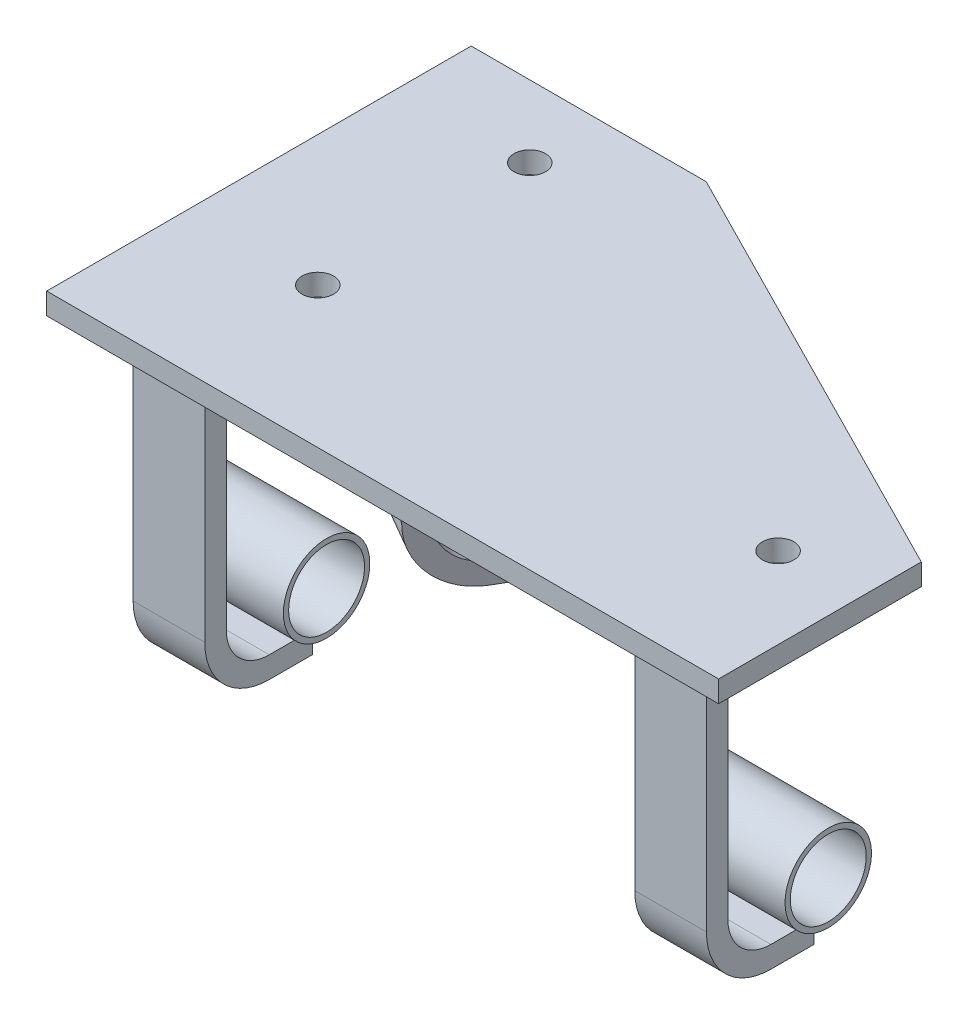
ISO-10303-21;
HEADER;
FILE_DESCRIPTION(('STEP AP214'),'2;1');
FILE_NAME('part.step','',(''),(''),'','','');
FILE_SCHEMA(('AUTOMOTIVE_DESIGN { 1 0 10303 214 1 1 1 1 }'));
ENDSEC;
DATA;
#1=APPLICATION_CONTEXT('core data for automotive mechanical design processes');
#2=APPLICATION_PROTOCOL_DEFINITION('international standard','automotive_design',2000,#1);
#3=PRODUCT_CONTEXT('',#1,'mechanical');
#4=PRODUCT('Part','Part','',(#3));
#5=PRODUCT_RELATED_PRODUCT_CATEGORY('part','',(#4));
#6=PRODUCT_DEFINITION_FORMATION('','',#4);
#7=PRODUCT_DEFINITION_CONTEXT('part definition',#1,'design');
#8=PRODUCT_DEFINITION('design','',#6,#7);
#9=PRODUCT_DEFINITION_SHAPE('','',#8);
#10=(LENGTH_UNIT() NAMED_UNIT(*) SI_UNIT(.MILLI.,.METRE.));
#11=(NAMED_UNIT(*) PLANE_ANGLE_UNIT() SI_UNIT($,.RADIAN.));
#12=(NAMED_UNIT(*) SI_UNIT($,.STERADIAN.) SOLID_ANGLE_UNIT());
#13=UNCERTAINTY_MEASURE_WITH_UNIT(LENGTH_MEASURE(1.E-05),#10,'distance_accuracy_value','');
#14=(GEOMETRIC_REPRESENTATION_CONTEXT(3) GLOBAL_UNCERTAINTY_ASSIGNED_CONTEXT((#13)) GLOBAL_UNIT_ASSIGNED_CONTEXT((#10,
#11,#12)) REPRESENTATION_CONTEXT('',''));
#15=CARTESIAN_POINT('',(0.,0.,0.));
#16=DIRECTION('',(0.,0.,1.));
#17=DIRECTION('',(1.,0.,0.));
#18=AXIS2_PLACEMENT_3D('',#15,#16,#17);
#19=CARTESIAN_POINT('',(21.6435212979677,180.15,-43.2596163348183));
#20=DIRECTION('',(-1.,0.,0.));
#21=DIRECTION('',(0.,0.,1.));
#22=AXIS2_PLACEMENT_3D('',#19,#20,#21);
#23=PLANE('',#22);
#24=DIRECTION('',(0.,0.,-1.));
#25=VECTOR('',#24,1.);
#26=CARTESIAN_POINT('',(21.6435212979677,165.15,-43.2596163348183));
#27=LINE('',#26,#25);
#28=CARTESIAN_POINT('',(21.6435212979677,165.15,98.1634343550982));
#29=VERTEX_POINT('',#28);
#30=CARTESIAN_POINT('',(21.6435212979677,165.15,-43.2596163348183));
#31=VERTEX_POINT('',#30);
#32=EDGE_CURVE('E98',#29,#31,#27,.T.);
#33=ORIENTED_EDGE('',*,*,#32,.T.);
#34=DIRECTION('',(0.,-1.,0.));
#35=VECTOR('',#34,1.);
#36=CARTESIAN_POINT('',(21.6435212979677,180.15,-43.2596163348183));
#37=LINE('',#36,#35);
#38=CARTESIAN_POINT('',(21.6435212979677,180.15,-43.2596163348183));
#39=VERTEX_POINT('',#38);
#40=EDGE_CURVE('E12',#39,#31,#37,.T.);
#41=ORIENTED_EDGE('',*,*,#40,.F.);
#42=DIRECTION('',(0.,0.,-1.));
#43=VECTOR('',#42,1.);
#44=CARTESIAN_POINT('',(21.6435212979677,180.15,-43.2596163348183));
#45=LINE('',#44,#43);
#46=CARTESIAN_POINT('',(21.6435212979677,180.15,98.1634343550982));
#47=VERTEX_POINT('',#46);
#48=EDGE_CURVE('E124',#47,#39,#45,.T.);
#49=ORIENTED_EDGE('',*,*,#48,.F.);
#50=DIRECTION('',(0.,-1.,0.));
#51=VECTOR('',#50,1.);
#52=CARTESIAN_POINT('',(21.6435212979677,180.15,98.1634343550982));
#53=LINE('',#52,#51);
#54=EDGE_CURVE('E111',#47,#29,#53,.T.);
#55=ORIENTED_EDGE('',*,*,#54,.T.);
#56=EDGE_LOOP('',(#33,#41,#49,#55));
#57=FACE_BOUND('',#56,.T.);
#58=ADVANCED_FACE('F48',(#57),#23,.F.);
#59=CARTESIAN_POINT('',(-283.113193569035,180.15,-197.961826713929));
#60=DIRECTION('',(-0.452644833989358,0.,0.891690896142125));
#61=DIRECTION('',(0.891690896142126,0.,0.452644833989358));
#62=AXIS2_PLACEMENT_3D('',#59,#60,#61);
#63=PLANE('',#62);
#64=DIRECTION('',(-0.891690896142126,0.,-0.452644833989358));
#65=VECTOR('',#64,1.);
#66=CARTESIAN_POINT('',(-283.113193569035,165.15,-197.961826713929));
#67=LINE('',#66,#65);
#68=CARTESIAN_POINT('',(-283.113193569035,165.15,-197.961826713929));
#69=VERTEX_POINT('',#68);
#70=EDGE_CURVE('E94',#31,#69,#67,.T.);
#71=ORIENTED_EDGE('',*,*,#70,.T.);
#72=DIRECTION('',(0.,-1.,0.));
#73=VECTOR('',#72,1.);
#74=CARTESIAN_POINT('',(-283.113193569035,180.15,-197.961826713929));
#75=LINE('',#74,#73);
#76=CARTESIAN_POINT('',(-283.113193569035,180.15,-197.961826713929));
#77=VERTEX_POINT('',#76);
#78=EDGE_CURVE('E55',#77,#69,#75,.T.);
#79=ORIENTED_EDGE('',*,*,#78,.F.);
#80=DIRECTION('',(-0.891690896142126,0.,-0.452644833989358));
#81=VECTOR('',#80,1.);
#82=CARTESIAN_POINT('',(-283.113193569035,180.15,-197.961826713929));
#83=LINE('',#82,#81);
#84=EDGE_CURVE('E107',#39,#77,#83,.T.);
#85=ORIENTED_EDGE('',*,*,#84,.F.);
#86=ORIENTED_EDGE('',*,*,#40,.T.);
#87=EDGE_LOOP('',(#71,#79,#85,#86));
#88=FACE_BOUND('',#87,.T.);
#89=ADVANCED_FACE('F106',(#88),#63,.F.);
#90=CARTESIAN_POINT('',(-447.110815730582,180.15,-197.961826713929));
#91=DIRECTION('',(0.,0.,1.));
#92=DIRECTION('',(1.,0.,0.));
#93=AXIS2_PLACEMENT_3D('',#90,#91,#92);
#94=PLANE('',#93);
#95=DIRECTION('',(-1.,0.,0.));
#96=VECTOR('',#95,1.);
#97=CARTESIAN_POINT('',(-447.110815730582,165.15,-197.961826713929));
#98=LINE('',#97,#96);
#99=CARTESIAN_POINT('',(-447.110815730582,165.15,-197.961826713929));
#100=VERTEX_POINT('',#99);
#101=EDGE_CURVE('E100',#69,#100,#98,.T.);
#102=ORIENTED_EDGE('',*,*,#101,.T.);
#103=DIRECTION('',(0.,-1.,0.));
#104=VECTOR('',#103,1.);
#105=CARTESIAN_POINT('',(-447.110815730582,180.15,-197.961826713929));
#106=LINE('',#105,#104);
#107=CARTESIAN_POINT('',(-447.110815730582,180.15,-197.961826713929));
#108=VERTEX_POINT('',#107);
#109=EDGE_CURVE('E135',#108,#100,#106,.T.);
#110=ORIENTED_EDGE('',*,*,#109,.F.);
#111=DIRECTION('',(-1.,0.,0.));
#112=VECTOR('',#111,1.);
#113=CARTESIAN_POINT('',(-447.110815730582,180.15,-197.961826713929));
#114=LINE('',#113,#112);
#115=EDGE_CURVE('E127',#77,#108,#114,.T.);
#116=ORIENTED_EDGE('',*,*,#115,.F.);
#117=ORIENTED_EDGE('',*,*,#78,.T.);
#118=EDGE_LOOP('',(#102,#110,#116,#117));
#119=FACE_BOUND('',#118,.T.);
#120=ADVANCED_FACE('F139',(#119),#94,.F.);
#121=CARTESIAN_POINT('',(-447.110815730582,180.15,98.1634343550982));
#122=DIRECTION('',(1.,0.,0.));
#123=DIRECTION('',(0.,0.,-1.));
#124=AXIS2_PLACEMENT_3D('',#121,#122,#123);
#125=PLANE('',#124);
#126=DIRECTION('',(0.,0.,1.));
#127=VECTOR('',#126,1.);
#128=CARTESIAN_POINT('',(-447.110815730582,165.15,98.1634343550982));
#129=LINE('',#128,#127);
#130=CARTESIAN_POINT('',(-447.110815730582,165.15,98.1634343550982));
#131=VERTEX_POINT('',#130);
#132=EDGE_CURVE('E120',#100,#131,#129,.T.);
#133=ORIENTED_EDGE('',*,*,#132,.T.);
#134=DIRECTION('',(0.,-1.,0.));
#135=VECTOR('',#134,1.);
#136=CARTESIAN_POINT('',(-447.110815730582,180.15,98.1634343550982));
#137=LINE('',#136,#135);
#138=CARTESIAN_POINT('',(-447.110815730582,180.15,98.1634343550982));
#139=VERTEX_POINT('',#138);
#140=EDGE_CURVE('E132',#139,#131,#137,.T.);
#141=ORIENTED_EDGE('',*,*,#140,.F.);
#142=DIRECTION('',(0.,0.,1.));
#143=VECTOR('',#142,1.);
#144=CARTESIAN_POINT('',(-447.110815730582,180.15,98.1634343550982));
#145=LINE('',#144,#143);
#146=EDGE_CURVE('E67',#108,#139,#145,.T.);
#147=ORIENTED_EDGE('',*,*,#146,.F.);
#148=ORIENTED_EDGE('',*,*,#109,.T.);
#149=EDGE_LOOP('',(#133,#141,#147,#148));
#150=FACE_BOUND('',#149,.T.);
#151=ADVANCED_FACE('F153',(#150),#125,.F.);
#152=CARTESIAN_POINT('',(21.6435212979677,180.15,98.1634343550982));
#153=DIRECTION('',(0.,0.,-1.));
#154=DIRECTION('',(-1.,0.,0.));
#155=AXIS2_PLACEMENT_3D('',#152,#153,#154);
#156=PLANE('',#155);
#157=DIRECTION('',(1.,0.,0.));
#158=VECTOR('',#157,1.);
#159=CARTESIAN_POINT('',(21.6435212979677,165.15,98.1634343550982));
#160=LINE('',#159,#158);
#161=EDGE_CURVE('E122',#131,#29,#160,.T.);
#162=ORIENTED_EDGE('',*,*,#161,.T.);
#163=ORIENTED_EDGE('',*,*,#54,.F.);
#164=DIRECTION('',(1.,0.,0.));
#165=VECTOR('',#164,1.);
#166=CARTESIAN_POINT('',(21.6435212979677,180.15,98.1634343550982));
#167=LINE('',#166,#165);
#168=EDGE_CURVE('E62',#139,#47,#167,.T.);
#169=ORIENTED_EDGE('',*,*,#168,.F.);
#170=ORIENTED_EDGE('',*,*,#140,.T.);
#171=EDGE_LOOP('',(#162,#163,#169,#170));
#172=FACE_BOUND('',#171,.T.);
#173=ADVANCED_FACE('F143',(#172),#156,.F.);
#174=CARTESIAN_POINT('',(21.6435212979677,180.15,98.1634343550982));
#175=DIRECTION('',(0.,-1.,0.));
#176=DIRECTION('',(0.,0.,-1.));
#177=AXIS2_PLACEMENT_3D('',#174,#175,#176);
#178=PLANE('',#177);
#179=CARTESIAN_POINT('',(-35.,180.15,0.));
#180=DIRECTION('',(0.,1.,0.));
#181=DIRECTION('',(0.,0.,1.));
#182=AXIS2_PLACEMENT_3D('',#179,#180,#181);
#183=CIRCLE('',#182,11.);
#184=CARTESIAN_POINT('',(-35.,180.15,11.));
#185=VERTEX_POINT('',#184);
#186=EDGE_CURVE('E213',#185,#185,#183,.T.);
#187=ORIENTED_EDGE('',*,*,#186,.F.);
#188=EDGE_LOOP('',(#187));
#189=FACE_BOUND('',#188,.T.);
#190=CARTESIAN_POINT('',(-356.146500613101,180.15,0.));
#191=DIRECTION('',(0.,1.,0.));
#192=DIRECTION('',(0.,0.,1.));
#193=AXIS2_PLACEMENT_3D('',#190,#191,#192);
#194=CIRCLE('',#193,11.);
#195=CARTESIAN_POINT('',(-356.146500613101,180.15,11.));
#196=VERTEX_POINT('',#195);
#197=EDGE_CURVE('E217',#196,#196,#194,.T.);
#198=ORIENTED_EDGE('',*,*,#197,.F.);
#199=EDGE_LOOP('',(#198));
#200=FACE_BOUND('',#199,.T.);
#201=CARTESIAN_POINT('',(-356.146500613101,180.15,-147.886251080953));
#202=DIRECTION('',(0.,1.,0.));
#203=DIRECTION('',(0.,0.,1.));
#204=AXIS2_PLACEMENT_3D('',#201,#202,#203);
#205=CIRCLE('',#204,11.);
#206=CARTESIAN_POINT('',(-356.146500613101,180.15,-136.886251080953));
#207=VERTEX_POINT('',#206);
#208=EDGE_CURVE('E112',#207,#207,#205,.T.);
#209=ORIENTED_EDGE('',*,*,#208,.F.);
#210=EDGE_LOOP('',(#209));
#211=FACE_BOUND('',#210,.T.);
#212=ORIENTED_EDGE('',*,*,#48,.T.);
#213=ORIENTED_EDGE('',*,*,#84,.T.);
#214=ORIENTED_EDGE('',*,*,#115,.T.);
#215=ORIENTED_EDGE('',*,*,#146,.T.);
#216=ORIENTED_EDGE('',*,*,#168,.T.);
#217=EDGE_LOOP('',(#212,#213,#214,#215,#216));
#218=FACE_BOUND('',#217,.T.);
#219=ADVANCED_FACE('F141',(#189,#200,#211,#218),#178,.F.);
#220=CARTESIAN_POINT('',(21.6435212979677,165.15,98.1634343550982));
#221=DIRECTION('',(0.,-1.,0.));
#222=DIRECTION('',(0.,0.,-1.));
#223=AXIS2_PLACEMENT_3D('',#220,#221,#222);
#224=PLANE('',#223);
#225=CARTESIAN_POINT('',(-35.,165.15,0.));
#226=DIRECTION('',(0.,-1.,0.));
#227=DIRECTION('',(0.,0.,-1.));
#228=AXIS2_PLACEMENT_3D('',#225,#226,#227);
#229=CIRCLE('',#228,11.);
#230=CARTESIAN_POINT('',(-35.,165.15,-11.));
#231=VERTEX_POINT('',#230);
#232=EDGE_CURVE('E211',#231,#231,#229,.F.);
#233=ORIENTED_EDGE('',*,*,#232,.T.);
#234=EDGE_LOOP('',(#233));
#235=FACE_BOUND('',#234,.T.);
#236=CARTESIAN_POINT('',(-356.146500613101,165.15,0.));
#237=DIRECTION('',(0.,-1.,0.));
#238=DIRECTION('',(0.,0.,-1.));
#239=AXIS2_PLACEMENT_3D('',#236,#237,#238);
#240=CIRCLE('',#239,11.);
#241=CARTESIAN_POINT('',(-356.146500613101,165.15,-11.));
#242=VERTEX_POINT('',#241);
#243=EDGE_CURVE('E214',#242,#242,#240,.F.);
#244=ORIENTED_EDGE('',*,*,#243,.T.);
#245=EDGE_LOOP('',(#244));
#246=FACE_BOUND('',#245,.T.);
#247=CARTESIAN_POINT('',(-356.146500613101,165.15,-147.886251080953));
#248=DIRECTION('',(0.,-1.,0.));
#249=DIRECTION('',(0.,0.,-1.));
#250=AXIS2_PLACEMENT_3D('',#247,#248,#249);
#251=CIRCLE('',#250,11.);
#252=CARTESIAN_POINT('',(-356.146500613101,165.15,-158.886251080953));
#253=VERTEX_POINT('',#252);
#254=EDGE_CURVE('E115',#253,#253,#251,.F.);
#255=ORIENTED_EDGE('',*,*,#254,.T.);
#256=EDGE_LOOP('',(#255));
#257=FACE_BOUND('',#256,.T.);
#258=ORIENTED_EDGE('',*,*,#32,.F.);
#259=ORIENTED_EDGE('',*,*,#161,.F.);
#260=ORIENTED_EDGE('',*,*,#132,.F.);
#261=ORIENTED_EDGE('',*,*,#101,.F.);
#262=ORIENTED_EDGE('',*,*,#70,.F.);
#263=EDGE_LOOP('',(#258,#259,#260,#261,#262));
#264=FACE_BOUND('',#263,.T.);
#265=ADVANCED_FACE('F95',(#235,#246,#257,#264),#224,.T.);
#266=CARTESIAN_POINT('',(-356.146500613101,-45.1510000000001,-147.886251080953));
#267=DIRECTION('',(0.,1.,0.));
#268=DIRECTION('',(0.,0.,1.));
#269=AXIS2_PLACEMENT_3D('',#266,#267,#268);
#270=CYLINDRICAL_SURFACE('',#269,11.);
#271=ORIENTED_EDGE('',*,*,#254,.F.);
#272=EDGE_LOOP('',(#271));
#273=FACE_BOUND('',#272,.T.);
#274=ORIENTED_EDGE('',*,*,#208,.T.);
#275=EDGE_LOOP('',(#274));
#276=FACE_BOUND('',#275,.T.);
#277=ADVANCED_FACE('F150',(#273,#276),#270,.F.);
#278=CARTESIAN_POINT('',(-356.146500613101,-45.1510000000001,0.));
#279=DIRECTION('',(0.,1.,0.));
#280=DIRECTION('',(0.,0.,1.));
#281=AXIS2_PLACEMENT_3D('',#278,#279,#280);
#282=CYLINDRICAL_SURFACE('',#281,11.);
#283=ORIENTED_EDGE('',*,*,#243,.F.);
#284=EDGE_LOOP('',(#283));
#285=FACE_BOUND('',#284,.T.);
#286=ORIENTED_EDGE('',*,*,#197,.T.);
#287=EDGE_LOOP('',(#286));
#288=FACE_BOUND('',#287,.T.);
#289=ADVANCED_FACE('F190',(#285,#288),#282,.F.);
#290=CARTESIAN_POINT('',(-35.,-45.1510000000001,0.));
#291=DIRECTION('',(0.,1.,0.));
#292=DIRECTION('',(0.,0.,1.));
#293=AXIS2_PLACEMENT_3D('',#290,#291,#292);
#294=CYLINDRICAL_SURFACE('',#293,11.);
#295=ORIENTED_EDGE('',*,*,#232,.F.);
#296=EDGE_LOOP('',(#295));
#297=FACE_BOUND('',#296,.T.);
#298=ORIENTED_EDGE('',*,*,#186,.T.);
#299=EDGE_LOOP('',(#298));
#300=FACE_BOUND('',#299,.T.);
#301=ADVANCED_FACE('F198',(#297,#300),#294,.F.);
#302=CLOSED_SHELL('',(#58,#89,#120,#151,#173,#219,#265,#277,#289,#301));
#303=MANIFOLD_SOLID_BREP('B2',#302);
#304=CARTESIAN_POINT('',(-398.467875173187,-30.15,-103.038475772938));
#305=DIRECTION('',(0.499999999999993,0.,-0.866025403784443));
#306=DIRECTION('',(-0.866025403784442,0.,-0.499999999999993));
#307=AXIS2_PLACEMENT_3D('',#304,#305,#306);
#308=PLANE('',#307);
#309=DIRECTION('',(0.,1.,0.));
#310=VECTOR('',#309,1.);
#311=CARTESIAN_POINT('',(-355.166604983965,-30.15,-78.0384757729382));
#312=LINE('',#311,#310);
#313=CARTESIAN_POINT('',(-355.166604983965,-0.150000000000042,-78.0384757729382));
#314=VERTEX_POINT('',#313);
#315=CARTESIAN_POINT('',(-355.166604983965,165.15,-78.0384757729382));
#316=VERTEX_POINT('',#315);
#317=EDGE_CURVE('E312',#314,#316,#312,.T.);
#318=ORIENTED_EDGE('',*,*,#317,.F.);
#319=DIRECTION('',(0.866025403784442,0.,0.499999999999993));
#320=VECTOR('',#319,1.);
#321=CARTESIAN_POINT('',(-398.467875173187,-0.150000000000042,-103.038475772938));
#322=LINE('',#321,#320);
#323=CARTESIAN_POINT('',(-398.467875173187,-0.150000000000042,-103.038475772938));
#324=VERTEX_POINT('',#323);
#325=EDGE_CURVE('E367',#314,#324,#322,.F.);
#326=ORIENTED_EDGE('',*,*,#325,.T.);
#327=DIRECTION('',(0.,1.,0.));
#328=VECTOR('',#327,1.);
#329=CARTESIAN_POINT('',(-398.467875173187,-30.15,-103.038475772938));
#330=LINE('',#329,#328);
#331=CARTESIAN_POINT('',(-398.467875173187,165.15,-103.038475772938));
#332=VERTEX_POINT('',#331);
#333=EDGE_CURVE('E325',#324,#332,#330,.T.);
#334=ORIENTED_EDGE('',*,*,#333,.T.);
#335=DIRECTION('',(0.866025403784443,0.,0.499999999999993));
#336=VECTOR('',#335,1.);
#337=CARTESIAN_POINT('',(-398.467875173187,165.15,-103.038475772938));
#338=LINE('',#337,#336);
#339=EDGE_CURVE('E323',#332,#316,#338,.T.);
#340=ORIENTED_EDGE('',*,*,#339,.T.);
#341=EDGE_LOOP('',(#318,#326,#334,#340));
#342=FACE_BOUND('',#341,.T.);
#343=ADVANCED_FACE('F251',(#342),#308,.T.);
#344=CARTESIAN_POINT('',(-368.467875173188,-30.15,-155.000000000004));
#345=DIRECTION('',(0.,1.,0.));
#346=DIRECTION('',(0.,0.,1.));
#347=AXIS2_PLACEMENT_3D('',#344,#345,#346);
#348=PLANE('',#347);
#349=DIRECTION('',(-0.499999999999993,0.,0.866025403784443));
#350=VECTOR('',#349,1.);
#351=CARTESIAN_POINT('',(-368.467875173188,-30.15,-155.000000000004));
#352=LINE('',#351,#350);
#353=CARTESIAN_POINT('',(-368.467875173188,-30.15,-155.000000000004));
#354=VERTEX_POINT('',#353);
#355=CARTESIAN_POINT('',(-383.467875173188,-30.15,-129.019237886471));
#356=VERTEX_POINT('',#355);
#357=EDGE_CURVE('E330',#354,#356,#352,.T.);
#358=ORIENTED_EDGE('',*,*,#357,.T.);
#359=DIRECTION('',(0.866025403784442,0.,0.499999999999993));
#360=VECTOR('',#359,1.);
#361=CARTESIAN_POINT('',(-340.166604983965,-30.15,-104.019237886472));
#362=LINE('',#361,#360);
#363=CARTESIAN_POINT('',(-340.166604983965,-30.15,-104.019237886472));
#364=VERTEX_POINT('',#363);
#365=EDGE_CURVE('E360',#356,#364,#362,.T.);
#366=ORIENTED_EDGE('',*,*,#365,.T.);
#367=DIRECTION('',(-0.499999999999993,0.,0.866025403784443));
#368=VECTOR('',#367,1.);
#369=CARTESIAN_POINT('',(-325.166604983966,-30.15,-130.000000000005));
#370=LINE('',#369,#368);
#371=CARTESIAN_POINT('',(-325.166604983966,-30.15,-130.000000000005));
#372=VERTEX_POINT('',#371);
#373=EDGE_CURVE('E343',#372,#364,#370,.T.);
#374=ORIENTED_EDGE('',*,*,#373,.F.);
#375=DIRECTION('',(0.866025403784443,0.,0.499999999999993));
#376=VECTOR('',#375,1.);
#377=CARTESIAN_POINT('',(-368.467875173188,-30.15,-155.000000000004));
#378=LINE('',#377,#376);
#379=EDGE_CURVE('E358',#354,#372,#378,.T.);
#380=ORIENTED_EDGE('',*,*,#379,.F.);
#381=EDGE_LOOP('',(#358,#366,#374,#380));
#382=FACE_BOUND('',#381,.T.);
#383=ADVANCED_FACE('F393',(#382),#348,.T.);
#384=CARTESIAN_POINT('',(-368.467875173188,-45.15,-155.000000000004));
#385=DIRECTION('',(0.499999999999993,0.,-0.866025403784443));
#386=DIRECTION('',(-0.866025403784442,0.,-0.499999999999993));
#387=AXIS2_PLACEMENT_3D('',#384,#385,#386);
#388=PLANE('',#387);
#389=DIRECTION('',(0.,1.,0.));
#390=VECTOR('',#389,1.);
#391=CARTESIAN_POINT('',(-325.166604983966,-45.15,-130.000000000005));
#392=LINE('',#391,#390);
#393=CARTESIAN_POINT('',(-325.166604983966,-45.15,-130.000000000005));
#394=VERTEX_POINT('',#393);
#395=EDGE_CURVE('E340',#394,#372,#392,.T.);
#396=ORIENTED_EDGE('',*,*,#395,.F.);
#397=DIRECTION('',(0.866025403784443,0.,0.499999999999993));
#398=VECTOR('',#397,1.);
#399=CARTESIAN_POINT('',(-368.467875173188,-45.15,-155.000000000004));
#400=LINE('',#399,#398);
#401=CARTESIAN_POINT('',(-368.467875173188,-45.15,-155.000000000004));
#402=VERTEX_POINT('',#401);
#403=EDGE_CURVE('E361',#402,#394,#400,.T.);
#404=ORIENTED_EDGE('',*,*,#403,.F.);
#405=DIRECTION('',(0.,1.,0.));
#406=VECTOR('',#405,1.);
#407=CARTESIAN_POINT('',(-368.467875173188,-45.15,-155.000000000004));
#408=LINE('',#407,#406);
#409=EDGE_CURVE('E353',#402,#354,#408,.T.);
#410=ORIENTED_EDGE('',*,*,#409,.T.);
#411=ORIENTED_EDGE('',*,*,#379,.T.);
#412=EDGE_LOOP('',(#396,#404,#410,#411));
#413=FACE_BOUND('',#412,.T.);
#414=ADVANCED_FACE('F390',(#413),#388,.T.);
#415=CARTESIAN_POINT('',(-405.967875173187,-45.15,-90.0480947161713));
#416=DIRECTION('',(0.,-1.,0.));
#417=DIRECTION('',(0.,0.,-1.));
#418=AXIS2_PLACEMENT_3D('',#415,#416,#417);
#419=PLANE('',#418);
#420=DIRECTION('',(0.499999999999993,0.,-0.866025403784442));
#421=VECTOR('',#420,1.);
#422=CARTESIAN_POINT('',(-362.666604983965,-45.15,-65.0480947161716));
#423=LINE('',#422,#421);
#424=CARTESIAN_POINT('',(-340.166604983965,-45.15,-104.019237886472));
#425=VERTEX_POINT('',#424);
#426=EDGE_CURVE('E336',#425,#394,#423,.T.);
#427=ORIENTED_EDGE('',*,*,#426,.F.);
#428=DIRECTION('',(0.866025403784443,0.,0.499999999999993));
#429=VECTOR('',#428,1.);
#430=CARTESIAN_POINT('',(-383.467875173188,-45.15,-129.019237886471));
#431=LINE('',#430,#429);
#432=CARTESIAN_POINT('',(-383.467875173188,-45.15,-129.019237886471));
#433=VERTEX_POINT('',#432);
#434=EDGE_CURVE('E258',#425,#433,#431,.F.);
#435=ORIENTED_EDGE('',*,*,#434,.T.);
#436=DIRECTION('',(0.499999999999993,0.,-0.866025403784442));
#437=VECTOR('',#436,1.);
#438=CARTESIAN_POINT('',(-405.967875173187,-45.15,-90.0480947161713));
#439=LINE('',#438,#437);
#440=EDGE_CURVE('E351',#433,#402,#439,.T.);
#441=ORIENTED_EDGE('',*,*,#440,.T.);
#442=ORIENTED_EDGE('',*,*,#403,.T.);
#443=EDGE_LOOP('',(#427,#435,#441,#442));
#444=FACE_BOUND('',#443,.T.);
#445=ADVANCED_FACE('F387',(#444),#419,.T.);
#446=CARTESIAN_POINT('',(-405.967875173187,165.15,-90.0480947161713));
#447=DIRECTION('',(-0.499999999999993,0.,0.866025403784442));
#448=DIRECTION('',(0.866025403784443,0.,0.499999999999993));
#449=AXIS2_PLACEMENT_3D('',#446,#447,#448);
#450=PLANE('',#449);
#451=DIRECTION('',(0.,-1.,0.));
#452=VECTOR('',#451,1.);
#453=CARTESIAN_POINT('',(-405.967875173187,165.15,-90.0480947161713));
#454=LINE('',#453,#452);
#455=CARTESIAN_POINT('',(-405.967875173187,165.15,-90.0480947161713));
#456=VERTEX_POINT('',#455);
#457=CARTESIAN_POINT('',(-405.967875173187,-0.149999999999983,-90.0480947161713));
#458=VERTEX_POINT('',#457);
#459=EDGE_CURVE('E348',#456,#458,#454,.T.);
#460=ORIENTED_EDGE('',*,*,#459,.T.);
#461=DIRECTION('',(0.866025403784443,0.,0.499999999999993));
#462=VECTOR('',#461,1.);
#463=CARTESIAN_POINT('',(-405.967875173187,-0.150000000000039,-90.0480947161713));
#464=LINE('',#463,#462);
#465=CARTESIAN_POINT('',(-362.666604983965,-0.149999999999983,-65.0480947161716));
#466=VERTEX_POINT('',#465);
#467=EDGE_CURVE('E372',#458,#466,#464,.T.);
#468=ORIENTED_EDGE('',*,*,#467,.T.);
#469=DIRECTION('',(0.,-1.,0.));
#470=VECTOR('',#469,1.);
#471=CARTESIAN_POINT('',(-362.666604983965,165.15,-65.0480947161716));
#472=LINE('',#471,#470);
#473=CARTESIAN_POINT('',(-362.666604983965,165.15,-65.0480947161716));
#474=VERTEX_POINT('',#473);
#475=EDGE_CURVE('E334',#474,#466,#472,.T.);
#476=ORIENTED_EDGE('',*,*,#475,.F.);
#477=DIRECTION('',(0.866025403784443,0.,0.499999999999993));
#478=VECTOR('',#477,1.);
#479=CARTESIAN_POINT('',(-405.967875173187,165.15,-90.0480947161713));
#480=LINE('',#479,#478);
#481=EDGE_CURVE('E329',#456,#474,#480,.T.);
#482=ORIENTED_EDGE('',*,*,#481,.F.);
#483=EDGE_LOOP('',(#460,#468,#476,#482));
#484=FACE_BOUND('',#483,.T.);
#485=ADVANCED_FACE('F377',(#484),#450,.T.);
#486=CARTESIAN_POINT('',(-398.467875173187,165.15,-103.038475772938));
#487=DIRECTION('',(0.,1.,0.));
#488=DIRECTION('',(0.,0.,1.));
#489=AXIS2_PLACEMENT_3D('',#486,#487,#488);
#490=PLANE('',#489);
#491=DIRECTION('',(-0.499999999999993,0.,0.866025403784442));
#492=VECTOR('',#491,1.);
#493=CARTESIAN_POINT('',(-355.166604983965,165.15,-78.0384757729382));
#494=LINE('',#493,#492);
#495=EDGE_CURVE('E316',#316,#474,#494,.T.);
#496=ORIENTED_EDGE('',*,*,#495,.F.);
#497=ORIENTED_EDGE('',*,*,#339,.F.);
#498=DIRECTION('',(-0.499999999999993,0.,0.866025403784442));
#499=VECTOR('',#498,1.);
#500=CARTESIAN_POINT('',(-398.467875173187,165.15,-103.038475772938));
#501=LINE('',#500,#499);
#502=EDGE_CURVE('E346',#332,#456,#501,.T.);
#503=ORIENTED_EDGE('',*,*,#502,.T.);
#504=ORIENTED_EDGE('',*,*,#481,.T.);
#505=EDGE_LOOP('',(#496,#497,#503,#504));
#506=FACE_BOUND('',#505,.T.);
#507=ADVANCED_FACE('F332',(#506),#490,.T.);
#508=CARTESIAN_POINT('',(-398.467875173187,165.15,-103.038475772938));
#509=DIRECTION('',(0.866025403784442,0.,0.499999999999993));
#510=DIRECTION('',(0.499999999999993,0.,-0.866025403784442));
#511=AXIS2_PLACEMENT_3D('',#508,#509,#510);
#512=PLANE('',#511);
#513=ORIENTED_EDGE('',*,*,#440,.F.);
#514=CARTESIAN_POINT('',(-383.467875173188,-0.150000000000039,-129.019237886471));
#515=DIRECTION('',(0.866025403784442,0.,0.499999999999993));
#516=DIRECTION('',(0.499999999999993,0.,-0.866025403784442));
#517=AXIS2_PLACEMENT_3D('',#514,#515,#516);
#518=CIRCLE('',#517,45.);
#519=EDGE_CURVE('E46',#433,#458,#518,.F.);
#520=ORIENTED_EDGE('',*,*,#519,.T.);
#521=ORIENTED_EDGE('',*,*,#459,.F.);
#522=ORIENTED_EDGE('',*,*,#502,.F.);
#523=ORIENTED_EDGE('',*,*,#333,.F.);
#524=CARTESIAN_POINT('',(-383.467875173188,-0.150000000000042,-129.019237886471));
#525=DIRECTION('',(0.866025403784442,0.,0.499999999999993));
#526=DIRECTION('',(0.499999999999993,0.,-0.866025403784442));
#527=AXIS2_PLACEMENT_3D('',#524,#525,#526);
#528=CIRCLE('',#527,30.);
#529=EDGE_CURVE('E370',#324,#356,#528,.T.);
#530=ORIENTED_EDGE('',*,*,#529,.T.);
#531=ORIENTED_EDGE('',*,*,#357,.F.);
#532=ORIENTED_EDGE('',*,*,#409,.F.);
#533=EDGE_LOOP('',(#513,#520,#521,#522,#523,#530,#531,#532));
#534=FACE_BOUND('',#533,.T.);
#535=ADVANCED_FACE('F383',(#534),#512,.F.);
#536=CARTESIAN_POINT('',(-355.166604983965,165.15,-78.0384757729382));
#537=DIRECTION('',(0.866025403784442,0.,0.499999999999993));
#538=DIRECTION('',(0.499999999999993,0.,-0.866025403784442));
#539=AXIS2_PLACEMENT_3D('',#536,#537,#538);
#540=PLANE('',#539);
#541=ORIENTED_EDGE('',*,*,#475,.T.);
#542=CARTESIAN_POINT('',(-340.166604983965,-0.150000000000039,-104.019237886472));
#543=DIRECTION('',(0.866025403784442,0.,0.499999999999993));
#544=DIRECTION('',(0.499999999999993,0.,-0.866025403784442));
#545=AXIS2_PLACEMENT_3D('',#542,#543,#544);
#546=CIRCLE('',#545,45.);
#547=EDGE_CURVE('E272',#466,#425,#546,.T.);
#548=ORIENTED_EDGE('',*,*,#547,.T.);
#549=ORIENTED_EDGE('',*,*,#426,.T.);
#550=ORIENTED_EDGE('',*,*,#395,.T.);
#551=ORIENTED_EDGE('',*,*,#373,.T.);
#552=CARTESIAN_POINT('',(-340.166604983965,-0.150000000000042,-104.019237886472));
#553=DIRECTION('',(0.866025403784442,0.,0.499999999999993));
#554=DIRECTION('',(0.499999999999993,0.,-0.866025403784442));
#555=AXIS2_PLACEMENT_3D('',#552,#553,#554);
#556=CIRCLE('',#555,30.);
#557=EDGE_CURVE('E318',#364,#314,#556,.F.);
#558=ORIENTED_EDGE('',*,*,#557,.T.);
#559=ORIENTED_EDGE('',*,*,#317,.T.);
#560=ORIENTED_EDGE('',*,*,#495,.T.);
#561=EDGE_LOOP('',(#541,#548,#549,#550,#551,#558,#559,#560));
#562=FACE_BOUND('',#561,.T.);
#563=ADVANCED_FACE('F314',(#562),#540,.T.);
#564=CARTESIAN_POINT('',(-383.467875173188,-0.150000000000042,-129.019237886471));
#565=DIRECTION('',(-0.866025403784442,0.,-0.499999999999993));
#566=DIRECTION('',(-0.499999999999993,0.,0.866025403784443));
#567=AXIS2_PLACEMENT_3D('',#564,#565,#566);
#568=CYLINDRICAL_SURFACE('',#567,30.);
#569=ORIENTED_EDGE('',*,*,#529,.F.);
#570=ORIENTED_EDGE('',*,*,#325,.F.);
#571=ORIENTED_EDGE('',*,*,#557,.F.);
#572=ORIENTED_EDGE('',*,*,#365,.F.);
#573=EDGE_LOOP('',(#569,#570,#571,#572));
#574=FACE_BOUND('',#573,.T.);
#575=ADVANCED_FACE('F397',(#574),#568,.F.);
#576=CARTESIAN_POINT('',(-383.467875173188,-0.150000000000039,-129.019237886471));
#577=DIRECTION('',(0.866025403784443,0.,0.499999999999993));
#578=DIRECTION('',(0.499999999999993,0.,-0.866025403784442));
#579=AXIS2_PLACEMENT_3D('',#576,#577,#578);
#580=CYLINDRICAL_SURFACE('',#579,45.);
#581=ORIENTED_EDGE('',*,*,#519,.F.);
#582=ORIENTED_EDGE('',*,*,#434,.F.);
#583=ORIENTED_EDGE('',*,*,#547,.F.);
#584=ORIENTED_EDGE('',*,*,#467,.F.);
#585=EDGE_LOOP('',(#581,#582,#583,#584));
#586=FACE_BOUND('',#585,.T.);
#587=ADVANCED_FACE('F381',(#586),#580,.T.);
#588=CLOSED_SHELL('',(#343,#383,#414,#445,#485,#507,#535,#563,#575,#587));
#589=MANIFOLD_SOLID_BREP('B6',#588);
#590=CARTESIAN_POINT('',(-410.000000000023,-45.15,1.05809891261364E-13));
#591=DIRECTION('',(0.,0.,-1.));
#592=DIRECTION('',(-1.,0.,0.));
#593=AXIS2_PLACEMENT_3D('',#590,#591,#592);
#594=PLANE('',#593);
#595=DIRECTION('',(0.,1.,0.));
#596=VECTOR('',#595,1.);
#597=CARTESIAN_POINT('',(-360.000000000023,-45.15,0.));
#598=LINE('',#597,#596);
#599=CARTESIAN_POINT('',(-360.000000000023,-45.15,0.));
#600=VERTEX_POINT('',#599);
#601=CARTESIAN_POINT('',(-360.000000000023,-30.15,0.));
#602=VERTEX_POINT('',#601);
#603=EDGE_CURVE('E535',#600,#602,#598,.T.);
#604=ORIENTED_EDGE('',*,*,#603,.F.);
#605=DIRECTION('',(1.,0.,0.));
#606=VECTOR('',#605,1.);
#607=CARTESIAN_POINT('',(-410.000000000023,-45.15,1.05809891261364E-13));
#608=LINE('',#607,#606);
#609=CARTESIAN_POINT('',(-410.000000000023,-45.15,1.05809891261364E-13));
#610=VERTEX_POINT('',#609);
#611=EDGE_CURVE('E576',#610,#600,#608,.T.);
#612=ORIENTED_EDGE('',*,*,#611,.F.);
#613=DIRECTION('',(0.,1.,0.));
#614=VECTOR('',#613,1.);
#615=CARTESIAN_POINT('',(-410.000000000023,-45.15,1.05809891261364E-13));
#616=LINE('',#615,#614);
#617=CARTESIAN_POINT('',(-410.000000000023,-30.15,1.05809891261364E-13));
#618=VERTEX_POINT('',#617);
#619=EDGE_CURVE('E537',#610,#618,#616,.T.);
#620=ORIENTED_EDGE('',*,*,#619,.T.);
#621=DIRECTION('',(1.,0.,0.));
#622=VECTOR('',#621,1.);
#623=CARTESIAN_POINT('',(-410.000000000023,-30.15,1.05809891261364E-13));
#624=LINE('',#623,#622);
#625=EDGE_CURVE('E531',#618,#602,#624,.T.);
#626=ORIENTED_EDGE('',*,*,#625,.T.);
#627=EDGE_LOOP('',(#604,#612,#620,#626));
#628=FACE_BOUND('',#627,.T.);
#629=ADVANCED_FACE('F469',(#628),#594,.T.);
#630=CARTESIAN_POINT('',(-410.000000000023,-45.15,75.0000000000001));
#631=DIRECTION('',(0.,-1.,0.));
#632=DIRECTION('',(0.,0.,-1.));
#633=AXIS2_PLACEMENT_3D('',#630,#631,#632);
#634=PLANE('',#633);
#635=DIRECTION('',(0.,0.,-1.));
#636=VECTOR('',#635,1.);
#637=CARTESIAN_POINT('',(-360.000000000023,-45.15,75.));
#638=LINE('',#637,#636);
#639=CARTESIAN_POINT('',(-360.000000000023,-45.15,30.0000000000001));
#640=VERTEX_POINT('',#639);
#641=EDGE_CURVE('E553',#640,#600,#638,.T.);
#642=ORIENTED_EDGE('',*,*,#641,.F.);
#643=DIRECTION('',(1.,0.,0.));
#644=VECTOR('',#643,1.);
#645=CARTESIAN_POINT('',(-410.000000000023,-45.15,30.0000000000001));
#646=LINE('',#645,#644);
#647=CARTESIAN_POINT('',(-410.000000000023,-45.15,30.0000000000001));
#648=VERTEX_POINT('',#647);
#649=EDGE_CURVE('E476',#640,#648,#646,.F.);
#650=ORIENTED_EDGE('',*,*,#649,.T.);
#651=DIRECTION('',(0.,0.,-1.));
#652=VECTOR('',#651,1.);
#653=CARTESIAN_POINT('',(-410.000000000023,-45.15,75.0000000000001));
#654=LINE('',#653,#652);
#655=EDGE_CURVE('E542',#648,#610,#654,.T.);
#656=ORIENTED_EDGE('',*,*,#655,.T.);
#657=ORIENTED_EDGE('',*,*,#611,.T.);
#658=EDGE_LOOP('',(#642,#650,#656,#657));
#659=FACE_BOUND('',#658,.T.);
#660=ADVANCED_FACE('F619',(#659),#634,.T.);
#661=CARTESIAN_POINT('',(-410.000000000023,165.15,75.0000000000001));
#662=DIRECTION('',(0.,0.,1.));
#663=DIRECTION('',(0.,-1.,0.));
#664=AXIS2_PLACEMENT_3D('',#661,#662,#663);
#665=PLANE('',#664);
#666=DIRECTION('',(0.,-1.,0.));
#667=VECTOR('',#666,1.);
#668=CARTESIAN_POINT('',(-410.000000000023,165.15,75.0000000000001));
#669=LINE('',#668,#667);
#670=CARTESIAN_POINT('',(-410.000000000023,165.15,75.0000000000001));
#671=VERTEX_POINT('',#670);
#672=CARTESIAN_POINT('',(-410.000000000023,-0.149999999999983,75.0000000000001));
#673=VERTEX_POINT('',#672);
#674=EDGE_CURVE('E572',#671,#673,#669,.T.);
#675=ORIENTED_EDGE('',*,*,#674,.T.);
#676=DIRECTION('',(1.,0.,0.));
#677=VECTOR('',#676,1.);
#678=CARTESIAN_POINT('',(-410.000000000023,-0.149999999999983,75.0000000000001));
#679=LINE('',#678,#677);
#680=CARTESIAN_POINT('',(-360.000000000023,-0.149999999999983,75.0000000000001));
#681=VERTEX_POINT('',#680);
#682=EDGE_CURVE('E589',#673,#681,#679,.T.);
#683=ORIENTED_EDGE('',*,*,#682,.T.);
#684=DIRECTION('',(0.,-1.,0.));
#685=VECTOR('',#684,1.);
#686=CARTESIAN_POINT('',(-360.000000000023,165.15,75.0000000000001));
#687=LINE('',#686,#685);
#688=CARTESIAN_POINT('',(-360.000000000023,165.15,75.0000000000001));
#689=VERTEX_POINT('',#688);
#690=EDGE_CURVE('E561',#689,#681,#687,.T.);
#691=ORIENTED_EDGE('',*,*,#690,.F.);
#692=DIRECTION('',(1.,0.,0.));
#693=VECTOR('',#692,1.);
#694=CARTESIAN_POINT('',(-410.000000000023,165.15,75.0000000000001));
#695=LINE('',#694,#693);
#696=EDGE_CURVE('E578',#671,#689,#695,.T.);
#697=ORIENTED_EDGE('',*,*,#696,.F.);
#698=EDGE_LOOP('',(#675,#683,#691,#697));
#699=FACE_BOUND('',#698,.T.);
#700=ADVANCED_FACE('F595',(#699),#665,.T.);
#701=CARTESIAN_POINT('',(-410.000000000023,165.15,60.0000000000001));
#702=DIRECTION('',(0.,1.,0.));
#703=DIRECTION('',(0.,0.,1.));
#704=AXIS2_PLACEMENT_3D('',#701,#702,#703);
#705=PLANE('',#704);
#706=DIRECTION('',(0.,0.,1.));
#707=VECTOR('',#706,1.);
#708=CARTESIAN_POINT('',(-360.000000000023,165.15,60.0000000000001));
#709=LINE('',#708,#707);
#710=CARTESIAN_POINT('',(-360.000000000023,165.15,60.0000000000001));
#711=VERTEX_POINT('',#710);
#712=EDGE_CURVE('E558',#711,#689,#709,.T.);
#713=ORIENTED_EDGE('',*,*,#712,.F.);
#714=DIRECTION('',(1.,0.,0.));
#715=VECTOR('',#714,1.);
#716=CARTESIAN_POINT('',(-410.000000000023,165.15,60.0000000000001));
#717=LINE('',#716,#715);
#718=CARTESIAN_POINT('',(-410.000000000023,165.15,60.0000000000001));
#719=VERTEX_POINT('',#718);
#720=EDGE_CURVE('E541',#719,#711,#717,.T.);
#721=ORIENTED_EDGE('',*,*,#720,.F.);
#722=DIRECTION('',(0.,0.,1.));
#723=VECTOR('',#722,1.);
#724=CARTESIAN_POINT('',(-410.000000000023,165.15,60.0000000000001));
#725=LINE('',#724,#723);
#726=EDGE_CURVE('E569',#719,#671,#725,.T.);
#727=ORIENTED_EDGE('',*,*,#726,.T.);
#728=ORIENTED_EDGE('',*,*,#696,.T.);
#729=EDGE_LOOP('',(#713,#721,#727,#728));
#730=FACE_BOUND('',#729,.T.);
#731=ADVANCED_FACE('F603',(#730),#705,.T.);
#732=CARTESIAN_POINT('',(-410.000000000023,-30.15,60.0000000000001));
#733=DIRECTION('',(0.,0.,-1.));
#734=DIRECTION('',(-1.,0.,0.));
#735=AXIS2_PLACEMENT_3D('',#732,#733,#734);
#736=PLANE('',#735);
#737=DIRECTION('',(0.,1.,0.));
#738=VECTOR('',#737,1.);
#739=CARTESIAN_POINT('',(-360.000000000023,-30.15,60.0000000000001));
#740=LINE('',#739,#738);
#741=CARTESIAN_POINT('',(-360.000000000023,-0.150000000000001,60.0000000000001));
#742=VERTEX_POINT('',#741);
#743=EDGE_CURVE('E550',#742,#711,#740,.T.);
#744=ORIENTED_EDGE('',*,*,#743,.F.);
#745=DIRECTION('',(1.,0.,0.));
#746=VECTOR('',#745,1.);
#747=CARTESIAN_POINT('',(-410.000000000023,-0.150000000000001,60.0000000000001));
#748=LINE('',#747,#746);
#749=CARTESIAN_POINT('',(-410.000000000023,-0.150000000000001,60.0000000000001));
#750=VERTEX_POINT('',#749);
#751=EDGE_CURVE('E583',#742,#750,#748,.F.);
#752=ORIENTED_EDGE('',*,*,#751,.T.);
#753=DIRECTION('',(0.,1.,0.));
#754=VECTOR('',#753,1.);
#755=CARTESIAN_POINT('',(-410.000000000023,-30.15,60.0000000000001));
#756=LINE('',#755,#754);
#757=EDGE_CURVE('E567',#750,#719,#756,.T.);
#758=ORIENTED_EDGE('',*,*,#757,.T.);
#759=ORIENTED_EDGE('',*,*,#720,.T.);
#760=EDGE_LOOP('',(#744,#752,#758,#759));
#761=FACE_BOUND('',#760,.T.);
#762=ADVANCED_FACE('F633',(#761),#736,.T.);
#763=CARTESIAN_POINT('',(-410.000000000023,-30.15,1.05809891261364E-13));
#764=DIRECTION('',(0.,1.,0.));
#765=DIRECTION('',(0.,0.,1.));
#766=AXIS2_PLACEMENT_3D('',#763,#764,#765);
#767=PLANE('',#766);
#768=DIRECTION('',(0.,0.,1.));
#769=VECTOR('',#768,1.);
#770=CARTESIAN_POINT('',(-410.000000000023,-30.15,1.05809891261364E-13));
#771=LINE('',#770,#769);
#772=CARTESIAN_POINT('',(-410.000000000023,-30.15,30.0000000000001));
#773=VERTEX_POINT('',#772);
#774=EDGE_CURVE('E565',#618,#773,#771,.T.);
#775=ORIENTED_EDGE('',*,*,#774,.T.);
#776=DIRECTION('',(1.,0.,0.));
#777=VECTOR('',#776,1.);
#778=CARTESIAN_POINT('',(-360.000000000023,-30.15,30.0000000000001));
#779=LINE('',#778,#777);
#780=CARTESIAN_POINT('',(-360.000000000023,-30.15,30.0000000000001));
#781=VERTEX_POINT('',#780);
#782=EDGE_CURVE('E549',#773,#781,#779,.T.);
#783=ORIENTED_EDGE('',*,*,#782,.T.);
#784=DIRECTION('',(0.,0.,1.));
#785=VECTOR('',#784,1.);
#786=CARTESIAN_POINT('',(-360.000000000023,-30.15,0.));
#787=LINE('',#786,#785);
#788=EDGE_CURVE('E546',#602,#781,#787,.T.);
#789=ORIENTED_EDGE('',*,*,#788,.F.);
#790=ORIENTED_EDGE('',*,*,#625,.F.);
#791=EDGE_LOOP('',(#775,#783,#789,#790));
#792=FACE_BOUND('',#791,.T.);
#793=ADVANCED_FACE('F547',(#792),#767,.T.);
#794=CARTESIAN_POINT('',(-410.000000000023,-30.15,1.05809891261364E-13));
#795=DIRECTION('',(1.,0.,0.));
#796=DIRECTION('',(0.,0.,-1.));
#797=AXIS2_PLACEMENT_3D('',#794,#795,#796);
#798=PLANE('',#797);
#799=ORIENTED_EDGE('',*,*,#655,.F.);
#800=CARTESIAN_POINT('',(-410.000000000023,-0.149999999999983,30.0000000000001));
#801=DIRECTION('',(1.,0.,0.));
#802=DIRECTION('',(0.,0.,-1.));
#803=AXIS2_PLACEMENT_3D('',#800,#801,#802);
#804=CIRCLE('',#803,45.);
#805=EDGE_CURVE('E249',#648,#673,#804,.F.);
#806=ORIENTED_EDGE('',*,*,#805,.T.);
#807=ORIENTED_EDGE('',*,*,#674,.F.);
#808=ORIENTED_EDGE('',*,*,#726,.F.);
#809=ORIENTED_EDGE('',*,*,#757,.F.);
#810=CARTESIAN_POINT('',(-410.000000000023,-0.150000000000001,30.0000000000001));
#811=DIRECTION('',(1.,0.,0.));
#812=DIRECTION('',(0.,0.,-1.));
#813=AXIS2_PLACEMENT_3D('',#810,#811,#812);
#814=CIRCLE('',#813,30.);
#815=EDGE_CURVE('E587',#750,#773,#814,.T.);
#816=ORIENTED_EDGE('',*,*,#815,.T.);
#817=ORIENTED_EDGE('',*,*,#774,.F.);
#818=ORIENTED_EDGE('',*,*,#619,.F.);
#819=EDGE_LOOP('',(#799,#806,#807,#808,#809,#816,#817,#818));
#820=FACE_BOUND('',#819,.T.);
#821=ADVANCED_FACE('F606',(#820),#798,.F.);
#822=CARTESIAN_POINT('',(-360.000000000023,-30.15,0.));
#823=DIRECTION('',(1.,0.,0.));
#824=DIRECTION('',(0.,0.,-1.));
#825=AXIS2_PLACEMENT_3D('',#822,#823,#824);
#826=PLANE('',#825);
#827=ORIENTED_EDGE('',*,*,#690,.T.);
#828=CARTESIAN_POINT('',(-360.000000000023,-0.149999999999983,30.));
#829=DIRECTION('',(1.,0.,0.));
#830=DIRECTION('',(0.,0.,-1.));
#831=AXIS2_PLACEMENT_3D('',#828,#829,#830);
#832=CIRCLE('',#831,45.);
#833=EDGE_CURVE('E490',#681,#640,#832,.T.);
#834=ORIENTED_EDGE('',*,*,#833,.T.);
#835=ORIENTED_EDGE('',*,*,#641,.T.);
#836=ORIENTED_EDGE('',*,*,#603,.T.);
#837=ORIENTED_EDGE('',*,*,#788,.T.);
#838=CARTESIAN_POINT('',(-360.000000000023,-0.150000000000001,30.0000000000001));
#839=DIRECTION('',(1.,0.,0.));
#840=DIRECTION('',(0.,0.,-1.));
#841=AXIS2_PLACEMENT_3D('',#838,#839,#840);
#842=CIRCLE('',#841,30.);
#843=EDGE_CURVE('E585',#781,#742,#842,.F.);
#844=ORIENTED_EDGE('',*,*,#843,.T.);
#845=ORIENTED_EDGE('',*,*,#743,.T.);
#846=ORIENTED_EDGE('',*,*,#712,.T.);
#847=EDGE_LOOP('',(#827,#834,#835,#836,#837,#844,#845,#846));
#848=FACE_BOUND('',#847,.T.);
#849=ADVANCED_FACE('F552',(#848),#826,.T.);
#850=CARTESIAN_POINT('',(-410.000000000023,-0.150000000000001,30.0000000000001));
#851=DIRECTION('',(-1.,0.,0.));
#852=DIRECTION('',(0.,0.,1.));
#853=AXIS2_PLACEMENT_3D('',#850,#851,#852);
#854=CYLINDRICAL_SURFACE('',#853,30.);
#855=ORIENTED_EDGE('',*,*,#815,.F.);
#856=ORIENTED_EDGE('',*,*,#751,.F.);
#857=ORIENTED_EDGE('',*,*,#843,.F.);
#858=ORIENTED_EDGE('',*,*,#782,.F.);
#859=EDGE_LOOP('',(#855,#856,#857,#858));
#860=FACE_BOUND('',#859,.T.);
#861=ADVANCED_FACE('F610',(#860),#854,.F.);
#862=CARTESIAN_POINT('',(-410.000000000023,-0.149999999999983,30.0000000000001));
#863=DIRECTION('',(1.,0.,0.));
#864=DIRECTION('',(0.,0.,-1.));
#865=AXIS2_PLACEMENT_3D('',#862,#863,#864);
#866=CYLINDRICAL_SURFACE('',#865,45.);
#867=ORIENTED_EDGE('',*,*,#805,.F.);
#868=ORIENTED_EDGE('',*,*,#649,.F.);
#869=ORIENTED_EDGE('',*,*,#833,.F.);
#870=ORIENTED_EDGE('',*,*,#682,.F.);
#871=EDGE_LOOP('',(#867,#868,#869,#870));
#872=FACE_BOUND('',#871,.T.);
#873=ADVANCED_FACE('F608',(#872),#866,.T.);
#874=CLOSED_SHELL('',(#629,#660,#700,#731,#762,#793,#821,#849,#861,#873));
#875=MANIFOLD_SOLID_BREP('B40',#874);
#876=CARTESIAN_POINT('',(-60.,-45.15,0.));
#877=DIRECTION('',(0.,0.,-1.));
#878=DIRECTION('',(-1.,0.,0.));
#879=AXIS2_PLACEMENT_3D('',#876,#877,#878);
#880=PLANE('',#879);
#881=DIRECTION('',(0.,1.,0.));
#882=VECTOR('',#881,1.);
#883=CARTESIAN_POINT('',(-10.,-45.15,0.));
#884=LINE('',#883,#882);
#885=CARTESIAN_POINT('',(-10.,-45.15,0.));
#886=VERTEX_POINT('',#885);
#887=CARTESIAN_POINT('',(-10.,-30.15,0.));
#888=VERTEX_POINT('',#887);
#889=EDGE_CURVE('E751',#886,#888,#884,.T.);
#890=ORIENTED_EDGE('',*,*,#889,.F.);
#891=DIRECTION('',(1.,0.,0.));
#892=VECTOR('',#891,1.);
#893=CARTESIAN_POINT('',(-60.,-45.15,0.));
#894=LINE('',#893,#892);
#895=CARTESIAN_POINT('',(-60.,-45.15,0.));
#896=VERTEX_POINT('',#895);
#897=EDGE_CURVE('E792',#896,#886,#894,.T.);
#898=ORIENTED_EDGE('',*,*,#897,.F.);
#899=DIRECTION('',(0.,1.,0.));
#900=VECTOR('',#899,1.);
#901=CARTESIAN_POINT('',(-60.,-45.15,0.));
#902=LINE('',#901,#900);
#903=CARTESIAN_POINT('',(-60.,-30.15,0.));
#904=VERTEX_POINT('',#903);
#905=EDGE_CURVE('E753',#896,#904,#902,.T.);
#906=ORIENTED_EDGE('',*,*,#905,.T.);
#907=DIRECTION('',(1.,0.,0.));
#908=VECTOR('',#907,1.);
#909=CARTESIAN_POINT('',(-60.,-30.15,0.));
#910=LINE('',#909,#908);
#911=EDGE_CURVE('E747',#904,#888,#910,.T.);
#912=ORIENTED_EDGE('',*,*,#911,.T.);
#913=EDGE_LOOP('',(#890,#898,#906,#912));
#914=FACE_BOUND('',#913,.T.);
#915=ADVANCED_FACE('F685',(#914),#880,.T.);
#916=CARTESIAN_POINT('',(-60.,-45.15,75.));
#917=DIRECTION('',(0.,-1.,0.));
#918=DIRECTION('',(0.,0.,-1.));
#919=AXIS2_PLACEMENT_3D('',#916,#917,#918);
#920=PLANE('',#919);
#921=DIRECTION('',(0.,0.,-1.));
#922=VECTOR('',#921,1.);
#923=CARTESIAN_POINT('',(-9.99999999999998,-45.15,75.));
#924=LINE('',#923,#922);
#925=CARTESIAN_POINT('',(-9.99999999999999,-45.15,30.));
#926=VERTEX_POINT('',#925);
#927=EDGE_CURVE('E769',#926,#886,#924,.T.);
#928=ORIENTED_EDGE('',*,*,#927,.F.);
#929=DIRECTION('',(1.,0.,0.));
#930=VECTOR('',#929,1.);
#931=CARTESIAN_POINT('',(-60.,-45.15,30.));
#932=LINE('',#931,#930);
#933=CARTESIAN_POINT('',(-60.,-45.15,30.));
#934=VERTEX_POINT('',#933);
#935=EDGE_CURVE('E692',#926,#934,#932,.F.);
#936=ORIENTED_EDGE('',*,*,#935,.T.);
#937=DIRECTION('',(0.,0.,-1.));
#938=VECTOR('',#937,1.);
#939=CARTESIAN_POINT('',(-60.,-45.15,75.));
#940=LINE('',#939,#938);
#941=EDGE_CURVE('E758',#934,#896,#940,.T.);
#942=ORIENTED_EDGE('',*,*,#941,.T.);
#943=ORIENTED_EDGE('',*,*,#897,.T.);
#944=EDGE_LOOP('',(#928,#936,#942,#943));
#945=FACE_BOUND('',#944,.T.);
#946=ADVANCED_FACE('F835',(#945),#920,.T.);
#947=CARTESIAN_POINT('',(-60.,165.15,75.));
#948=DIRECTION('',(0.,0.,1.));
#949=DIRECTION('',(1.,0.,0.));
#950=AXIS2_PLACEMENT_3D('',#947,#948,#949);
#951=PLANE('',#950);
#952=DIRECTION('',(0.,-1.,0.));
#953=VECTOR('',#952,1.);
#954=CARTESIAN_POINT('',(-60.,165.15,75.));
#955=LINE('',#954,#953);
#956=CARTESIAN_POINT('',(-60.,165.15,75.));
#957=VERTEX_POINT('',#956);
#958=CARTESIAN_POINT('',(-60.,-0.149999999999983,75.));
#959=VERTEX_POINT('',#958);
#960=EDGE_CURVE('E788',#957,#959,#955,.T.);
#961=ORIENTED_EDGE('',*,*,#960,.T.);
#962=DIRECTION('',(1.,0.,0.));
#963=VECTOR('',#962,1.);
#964=CARTESIAN_POINT('',(-60.,-0.149999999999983,75.));
#965=LINE('',#964,#963);
#966=CARTESIAN_POINT('',(-9.99999999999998,-0.149999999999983,75.));
#967=VERTEX_POINT('',#966);
#968=EDGE_CURVE('E805',#959,#967,#965,.T.);
#969=ORIENTED_EDGE('',*,*,#968,.T.);
#970=DIRECTION('',(0.,-1.,0.));
#971=VECTOR('',#970,1.);
#972=CARTESIAN_POINT('',(-9.99999999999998,165.15,75.));
#973=LINE('',#972,#971);
#974=CARTESIAN_POINT('',(-9.99999999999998,165.15,75.));
#975=VERTEX_POINT('',#974);
#976=EDGE_CURVE('E777',#975,#967,#973,.T.);
#977=ORIENTED_EDGE('',*,*,#976,.F.);
#978=DIRECTION('',(1.,0.,0.));
#979=VECTOR('',#978,1.);
#980=CARTESIAN_POINT('',(-60.,165.15,75.));
#981=LINE('',#980,#979);
#982=EDGE_CURVE('E794',#957,#975,#981,.T.);
#983=ORIENTED_EDGE('',*,*,#982,.F.);
#984=EDGE_LOOP('',(#961,#969,#977,#983));
#985=FACE_BOUND('',#984,.T.);
#986=ADVANCED_FACE('F811',(#985),#951,.T.);
#987=CARTESIAN_POINT('',(-60.,165.15,60.));
#988=DIRECTION('',(0.,1.,0.));
#989=DIRECTION('',(0.,0.,1.));
#990=AXIS2_PLACEMENT_3D('',#987,#988,#989);
#991=PLANE('',#990);
#992=DIRECTION('',(0.,0.,1.));
#993=VECTOR('',#992,1.);
#994=CARTESIAN_POINT('',(-9.99999999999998,165.15,60.));
#995=LINE('',#994,#993);
#996=CARTESIAN_POINT('',(-9.99999999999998,165.15,60.));
#997=VERTEX_POINT('',#996);
#998=EDGE_CURVE('E774',#997,#975,#995,.T.);
#999=ORIENTED_EDGE('',*,*,#998,.F.);
#1000=DIRECTION('',(1.,0.,0.));
#1001=VECTOR('',#1000,1.);
#1002=CARTESIAN_POINT('',(-60.,165.15,60.));
#1003=LINE('',#1002,#1001);
#1004=CARTESIAN_POINT('',(-60.,165.15,60.));
#1005=VERTEX_POINT('',#1004);
#1006=EDGE_CURVE('E757',#1005,#997,#1003,.T.);
#1007=ORIENTED_EDGE('',*,*,#1006,.F.);
#1008=DIRECTION('',(0.,0.,1.));
#1009=VECTOR('',#1008,1.);
#1010=CARTESIAN_POINT('',(-60.,165.15,60.));
#1011=LINE('',#1010,#1009);
#1012=EDGE_CURVE('E785',#1005,#957,#1011,.T.);
#1013=ORIENTED_EDGE('',*,*,#1012,.T.);
#1014=ORIENTED_EDGE('',*,*,#982,.T.);
#1015=EDGE_LOOP('',(#999,#1007,#1013,#1014));
#1016=FACE_BOUND('',#1015,.T.);
#1017=ADVANCED_FACE('F819',(#1016),#991,.T.);
#1018=CARTESIAN_POINT('',(-60.,-30.15,60.));
#1019=DIRECTION('',(0.,0.,-1.));
#1020=DIRECTION('',(-1.,0.,0.));
#1021=AXIS2_PLACEMENT_3D('',#1018,#1019,#1020);
#1022=PLANE('',#1021);
#1023=DIRECTION('',(0.,1.,0.));
#1024=VECTOR('',#1023,1.);
#1025=CARTESIAN_POINT('',(-9.99999999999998,-30.15,60.));
#1026=LINE('',#1025,#1024);
#1027=CARTESIAN_POINT('',(-9.99999999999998,-0.150000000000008,60.));
#1028=VERTEX_POINT('',#1027);
#1029=EDGE_CURVE('E766',#1028,#997,#1026,.T.);
#1030=ORIENTED_EDGE('',*,*,#1029,.F.);
#1031=DIRECTION('',(1.,0.,0.));
#1032=VECTOR('',#1031,1.);
#1033=CARTESIAN_POINT('',(-60.,-0.150000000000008,60.));
#1034=LINE('',#1033,#1032);
#1035=CARTESIAN_POINT('',(-60.,-0.150000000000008,60.));
#1036=VERTEX_POINT('',#1035);
#1037=EDGE_CURVE('E799',#1028,#1036,#1034,.F.);
#1038=ORIENTED_EDGE('',*,*,#1037,.T.);
#1039=DIRECTION('',(0.,1.,0.));
#1040=VECTOR('',#1039,1.);
#1041=CARTESIAN_POINT('',(-60.,-30.15,60.));
#1042=LINE('',#1041,#1040);
#1043=EDGE_CURVE('E783',#1036,#1005,#1042,.T.);
#1044=ORIENTED_EDGE('',*,*,#1043,.T.);
#1045=ORIENTED_EDGE('',*,*,#1006,.T.);
#1046=EDGE_LOOP('',(#1030,#1038,#1044,#1045));
#1047=FACE_BOUND('',#1046,.T.);
#1048=ADVANCED_FACE('F849',(#1047),#1022,.T.);
#1049=CARTESIAN_POINT('',(-60.,-30.15,0.));
#1050=DIRECTION('',(0.,1.,0.));
#1051=DIRECTION('',(0.,0.,1.));
#1052=AXIS2_PLACEMENT_3D('',#1049,#1050,#1051);
#1053=PLANE('',#1052);
#1054=DIRECTION('',(0.,0.,1.));
#1055=VECTOR('',#1054,1.);
#1056=CARTESIAN_POINT('',(-60.,-30.15,0.));
#1057=LINE('',#1056,#1055);
#1058=CARTESIAN_POINT('',(-60.,-30.15,30.));
#1059=VERTEX_POINT('',#1058);
#1060=EDGE_CURVE('E781',#904,#1059,#1057,.T.);
#1061=ORIENTED_EDGE('',*,*,#1060,.T.);
#1062=DIRECTION('',(1.,0.,0.));
#1063=VECTOR('',#1062,1.);
#1064=CARTESIAN_POINT('',(-9.99999999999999,-30.15,30.));
#1065=LINE('',#1064,#1063);
#1066=CARTESIAN_POINT('',(-9.99999999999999,-30.15,30.));
#1067=VERTEX_POINT('',#1066);
#1068=EDGE_CURVE('E765',#1059,#1067,#1065,.T.);
#1069=ORIENTED_EDGE('',*,*,#1068,.T.);
#1070=DIRECTION('',(0.,0.,1.));
#1071=VECTOR('',#1070,1.);
#1072=CARTESIAN_POINT('',(-10.,-30.15,0.));
#1073=LINE('',#1072,#1071);
#1074=EDGE_CURVE('E762',#888,#1067,#1073,.T.);
#1075=ORIENTED_EDGE('',*,*,#1074,.F.);
#1076=ORIENTED_EDGE('',*,*,#911,.F.);
#1077=EDGE_LOOP('',(#1061,#1069,#1075,#1076));
#1078=FACE_BOUND('',#1077,.T.);
#1079=ADVANCED_FACE('F763',(#1078),#1053,.T.);
#1080=CARTESIAN_POINT('',(-60.,165.15,0.));
#1081=DIRECTION('',(1.,0.,0.));
#1082=DIRECTION('',(0.,0.,-1.));
#1083=AXIS2_PLACEMENT_3D('',#1080,#1081,#1082);
#1084=PLANE('',#1083);
#1085=ORIENTED_EDGE('',*,*,#941,.F.);
#1086=CARTESIAN_POINT('',(-60.,-0.149999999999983,30.));
#1087=DIRECTION('',(1.,0.,0.));
#1088=DIRECTION('',(0.,0.,-1.));
#1089=AXIS2_PLACEMENT_3D('',#1086,#1087,#1088);
#1090=CIRCLE('',#1089,45.);
#1091=EDGE_CURVE('E467',#934,#959,#1090,.F.);
#1092=ORIENTED_EDGE('',*,*,#1091,.T.);
#1093=ORIENTED_EDGE('',*,*,#960,.F.);
#1094=ORIENTED_EDGE('',*,*,#1012,.F.);
#1095=ORIENTED_EDGE('',*,*,#1043,.F.);
#1096=CARTESIAN_POINT('',(-60.,-0.150000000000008,30.));
#1097=DIRECTION('',(1.,0.,0.));
#1098=DIRECTION('',(0.,0.,-1.));
#1099=AXIS2_PLACEMENT_3D('',#1096,#1097,#1098);
#1100=CIRCLE('',#1099,30.);
#1101=EDGE_CURVE('E803',#1036,#1059,#1100,.T.);
#1102=ORIENTED_EDGE('',*,*,#1101,.T.);
#1103=ORIENTED_EDGE('',*,*,#1060,.F.);
#1104=ORIENTED_EDGE('',*,*,#905,.F.);
#1105=EDGE_LOOP('',(#1085,#1092,#1093,#1094,#1095,#1102,#1103,#1104));
#1106=FACE_BOUND('',#1105,.T.);
#1107=ADVANCED_FACE('F822',(#1106),#1084,.F.);
#1108=CARTESIAN_POINT('',(-10.,165.15,0.));
#1109=DIRECTION('',(1.,0.,0.));
#1110=DIRECTION('',(0.,0.,-1.));
#1111=AXIS2_PLACEMENT_3D('',#1108,#1109,#1110);
#1112=PLANE('',#1111);
#1113=ORIENTED_EDGE('',*,*,#976,.T.);
#1114=CARTESIAN_POINT('',(-9.99999999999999,-0.149999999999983,30.));
#1115=DIRECTION('',(1.,0.,0.));
#1116=DIRECTION('',(0.,0.,-1.));
#1117=AXIS2_PLACEMENT_3D('',#1114,#1115,#1116);
#1118=CIRCLE('',#1117,45.);
#1119=EDGE_CURVE('E706',#967,#926,#1118,.T.);
#1120=ORIENTED_EDGE('',*,*,#1119,.T.);
#1121=ORIENTED_EDGE('',*,*,#927,.T.);
#1122=ORIENTED_EDGE('',*,*,#889,.T.);
#1123=ORIENTED_EDGE('',*,*,#1074,.T.);
#1124=CARTESIAN_POINT('',(-9.99999999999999,-0.150000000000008,30.));
#1125=DIRECTION('',(1.,0.,0.));
#1126=DIRECTION('',(0.,0.,-1.));
#1127=AXIS2_PLACEMENT_3D('',#1124,#1125,#1126);
#1128=CIRCLE('',#1127,30.);
#1129=EDGE_CURVE('E801',#1067,#1028,#1128,.F.);
#1130=ORIENTED_EDGE('',*,*,#1129,.T.);
#1131=ORIENTED_EDGE('',*,*,#1029,.T.);
#1132=ORIENTED_EDGE('',*,*,#998,.T.);
#1133=EDGE_LOOP('',(#1113,#1120,#1121,#1122,#1123,#1130,#1131,#1132));
#1134=FACE_BOUND('',#1133,.T.);
#1135=ADVANCED_FACE('F768',(#1134),#1112,.T.);
#1136=CARTESIAN_POINT('',(-60.,-0.150000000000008,30.));
#1137=DIRECTION('',(-1.,0.,0.));
#1138=DIRECTION('',(0.,0.,1.));
#1139=AXIS2_PLACEMENT_3D('',#1136,#1137,#1138);
#1140=CYLINDRICAL_SURFACE('',#1139,30.);
#1141=ORIENTED_EDGE('',*,*,#1101,.F.);
#1142=ORIENTED_EDGE('',*,*,#1037,.F.);
#1143=ORIENTED_EDGE('',*,*,#1129,.F.);
#1144=ORIENTED_EDGE('',*,*,#1068,.F.);
#1145=EDGE_LOOP('',(#1141,#1142,#1143,#1144));
#1146=FACE_BOUND('',#1145,.T.);
#1147=ADVANCED_FACE('F826',(#1146),#1140,.F.);
#1148=CARTESIAN_POINT('',(-60.,-0.149999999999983,30.));
#1149=DIRECTION('',(1.,0.,0.));
#1150=DIRECTION('',(0.,0.,-1.));
#1151=AXIS2_PLACEMENT_3D('',#1148,#1149,#1150);
#1152=CYLINDRICAL_SURFACE('',#1151,45.);
#1153=ORIENTED_EDGE('',*,*,#1091,.F.);
#1154=ORIENTED_EDGE('',*,*,#935,.F.);
#1155=ORIENTED_EDGE('',*,*,#1119,.F.);
#1156=ORIENTED_EDGE('',*,*,#968,.F.);
#1157=EDGE_LOOP('',(#1153,#1154,#1155,#1156));
#1158=FACE_BOUND('',#1157,.T.);
#1159=ADVANCED_FACE('F824',(#1158),#1152,.T.);
#1160=CLOSED_SHELL('',(#915,#946,#986,#1017,#1048,#1079,#1107,#1135,#1147,#1159));
#1161=MANIFOLD_SOLID_BREP('B243',#1160);
#1162=CARTESIAN_POINT('',(-316.50635094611,0.,-124.999999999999));
#1163=DIRECTION('',(-0.866025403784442,0.,-0.499999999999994));
#1164=DIRECTION('',(-0.499999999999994,0.,0.866025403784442));
#1165=AXIS2_PLACEMENT_3D('',#1162,#1163,#1164);
#1166=CYLINDRICAL_SURFACE('',#1165,26.5);
#1167=CARTESIAN_POINT('',(-316.50635094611,0.,-124.999999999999));
#1168=DIRECTION('',(0.866025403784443,0.,0.499999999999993));
#1169=DIRECTION('',(0.499999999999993,0.,-0.866025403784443));
#1170=AXIS2_PLACEMENT_3D('',#1167,#1168,#1169);
#1171=CIRCLE('',#1170,26.5);
#1172=CARTESIAN_POINT('',(-303.256350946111,0.,-147.949673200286));
#1173=VERTEX_POINT('',#1172);
#1174=EDGE_CURVE('E907',#1173,#1173,#1171,.T.);
#1175=ORIENTED_EDGE('',*,*,#1174,.T.);
#1176=EDGE_LOOP('',(#1175));
#1177=FACE_BOUND('',#1176,.T.);
#1178=CARTESIAN_POINT('',(-403.108891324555,0.,-174.999999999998));
#1179=DIRECTION('',(0.866025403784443,0.,0.499999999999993));
#1180=DIRECTION('',(0.499999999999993,0.,-0.866025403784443));
#1181=AXIS2_PLACEMENT_3D('',#1178,#1179,#1180);
#1182=CIRCLE('',#1181,26.5);
#1183=CARTESIAN_POINT('',(-389.858891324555,0.,-197.949673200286));
#1184=VERTEX_POINT('',#1183);
#1185=EDGE_CURVE('E915',#1184,#1184,#1182,.T.);
#1186=ORIENTED_EDGE('',*,*,#1185,.F.);
#1187=EDGE_LOOP('',(#1186));
#1188=FACE_BOUND('',#1187,.T.);
#1189=ADVANCED_FACE('F901',(#1177,#1188),#1166,.F.);
#1190=CARTESIAN_POINT('',(-316.50635094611,0.,-124.999999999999));
#1191=DIRECTION('',(-0.866025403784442,0.,-0.499999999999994));
#1192=DIRECTION('',(-0.499999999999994,0.,0.866025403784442));
#1193=AXIS2_PLACEMENT_3D('',#1190,#1191,#1192);
#1194=CYLINDRICAL_SURFACE('',#1193,30.15);
#1195=CARTESIAN_POINT('',(-316.50635094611,0.,-124.999999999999));
#1196=DIRECTION('',(0.866025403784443,0.,0.499999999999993));
#1197=DIRECTION('',(0.499999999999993,0.,-0.866025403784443));
#1198=AXIS2_PLACEMENT_3D('',#1195,#1196,#1197);
#1199=CIRCLE('',#1198,30.15);
#1200=CARTESIAN_POINT('',(-301.431350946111,0.,-151.1106659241));
#1201=VERTEX_POINT('',#1200);
#1202=EDGE_CURVE('E684',#1201,#1201,#1199,.T.);
#1203=ORIENTED_EDGE('',*,*,#1202,.F.);
#1204=EDGE_LOOP('',(#1203));
#1205=FACE_BOUND('',#1204,.T.);
#1206=CARTESIAN_POINT('',(-403.108891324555,0.,-174.999999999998));
#1207=DIRECTION('',(0.866025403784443,0.,0.499999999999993));
#1208=DIRECTION('',(0.499999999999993,0.,-0.866025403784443));
#1209=AXIS2_PLACEMENT_3D('',#1206,#1207,#1208);
#1210=CIRCLE('',#1209,30.15);
#1211=CARTESIAN_POINT('',(-388.033891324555,0.,-201.110665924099));
#1212=VERTEX_POINT('',#1211);
#1213=EDGE_CURVE('E911',#1212,#1212,#1210,.T.);
#1214=ORIENTED_EDGE('',*,*,#1213,.T.);
#1215=EDGE_LOOP('',(#1214));
#1216=FACE_BOUND('',#1215,.T.);
#1217=ADVANCED_FACE('F925',(#1205,#1216),#1194,.T.);
#1218=CARTESIAN_POINT('',(-316.50635094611,0.,-124.999999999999));
#1219=DIRECTION('',(0.866025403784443,0.,0.499999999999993));
#1220=DIRECTION('',(0.499999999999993,0.,-0.866025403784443));
#1221=AXIS2_PLACEMENT_3D('',#1218,#1219,#1220);
#1222=PLANE('',#1221);
#1223=ORIENTED_EDGE('',*,*,#1174,.F.);
#1224=EDGE_LOOP('',(#1223));
#1225=FACE_BOUND('',#1224,.T.);
#1226=ORIENTED_EDGE('',*,*,#1202,.T.);
#1227=EDGE_LOOP('',(#1226));
#1228=FACE_BOUND('',#1227,.T.);
#1229=ADVANCED_FACE('F929',(#1225,#1228),#1222,.T.);
#1230=CARTESIAN_POINT('',(-403.108891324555,0.,-174.999999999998));
#1231=DIRECTION('',(0.866025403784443,0.,0.499999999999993));
#1232=DIRECTION('',(0.499999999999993,0.,-0.866025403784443));
#1233=AXIS2_PLACEMENT_3D('',#1230,#1231,#1232);
#1234=PLANE('',#1233);
#1235=ORIENTED_EDGE('',*,*,#1185,.T.);
#1236=EDGE_LOOP('',(#1235));
#1237=FACE_BOUND('',#1236,.T.);
#1238=ORIENTED_EDGE('',*,*,#1213,.F.);
#1239=EDGE_LOOP('',(#1238));
#1240=FACE_BOUND('',#1239,.T.);
#1241=ADVANCED_FACE('F921',(#1237,#1240),#1234,.F.);
#1242=CLOSED_SHELL('',(#1189,#1217,#1229,#1241));
#1243=MANIFOLD_SOLID_BREP('B461',#1242);
#1244=CARTESIAN_POINT('',(-100.,0.,0.));
#1245=DIRECTION('',(1.,0.,0.));
#1246=DIRECTION('',(0.,0.,-1.));
#1247=AXIS2_PLACEMENT_3D('',#1244,#1245,#1246);
#1248=CYLINDRICAL_SURFACE('',#1247,26.5);
#1249=CARTESIAN_POINT('',(-100.,0.,0.));
#1250=DIRECTION('',(-1.,0.,0.));
#1251=DIRECTION('',(0.,0.,1.));
#1252=AXIS2_PLACEMENT_3D('',#1249,#1250,#1251);
#1253=CIRCLE('',#1252,26.5);
#1254=CARTESIAN_POINT('',(-100.,0.,26.5));
#1255=VERTEX_POINT('',#1254);
#1256=EDGE_CURVE('E976',#1255,#1255,#1253,.T.);
#1257=ORIENTED_EDGE('',*,*,#1256,.T.);
#1258=EDGE_LOOP('',(#1257));
#1259=FACE_BOUND('',#1258,.T.);
#1260=CARTESIAN_POINT('',(0.,0.,0.));
#1261=DIRECTION('',(-1.,0.,0.));
#1262=DIRECTION('',(0.,0.,1.));
#1263=AXIS2_PLACEMENT_3D('',#1260,#1261,#1262);
#1264=CIRCLE('',#1263,26.5);
#1265=CARTESIAN_POINT('',(0.,0.,26.5));
#1266=VERTEX_POINT('',#1265);
#1267=EDGE_CURVE('E984',#1266,#1266,#1264,.T.);
#1268=ORIENTED_EDGE('',*,*,#1267,.F.);
#1269=EDGE_LOOP('',(#1268));
#1270=FACE_BOUND('',#1269,.T.);
#1271=ADVANCED_FACE('F970',(#1259,#1270),#1248,.F.);
#1272=CARTESIAN_POINT('',(-100.,0.,0.));
#1273=DIRECTION('',(1.,0.,0.));
#1274=DIRECTION('',(0.,0.,-1.));
#1275=AXIS2_PLACEMENT_3D('',#1272,#1273,#1274);
#1276=CYLINDRICAL_SURFACE('',#1275,30.15);
#1277=CARTESIAN_POINT('',(-100.,0.,0.));
#1278=DIRECTION('',(-1.,0.,0.));
#1279=DIRECTION('',(0.,0.,1.));
#1280=AXIS2_PLACEMENT_3D('',#1277,#1278,#1279);
#1281=CIRCLE('',#1280,30.15);
#1282=CARTESIAN_POINT('',(-100.,0.,30.15));
#1283=VERTEX_POINT('',#1282);
#1284=EDGE_CURVE('E900',#1283,#1283,#1281,.T.);
#1285=ORIENTED_EDGE('',*,*,#1284,.F.);
#1286=EDGE_LOOP('',(#1285));
#1287=FACE_BOUND('',#1286,.T.);
#1288=CARTESIAN_POINT('',(0.,0.,0.));
#1289=DIRECTION('',(-1.,0.,0.));
#1290=DIRECTION('',(0.,0.,1.));
#1291=AXIS2_PLACEMENT_3D('',#1288,#1289,#1290);
#1292=CIRCLE('',#1291,30.15);
#1293=CARTESIAN_POINT('',(0.,0.,30.15));
#1294=VERTEX_POINT('',#1293);
#1295=EDGE_CURVE('E980',#1294,#1294,#1292,.T.);
#1296=ORIENTED_EDGE('',*,*,#1295,.T.);
#1297=EDGE_LOOP('',(#1296));
#1298=FACE_BOUND('',#1297,.T.);
#1299=ADVANCED_FACE('F994',(#1287,#1298),#1276,.T.);
#1300=CARTESIAN_POINT('',(-100.,0.,0.));
#1301=DIRECTION('',(-1.,0.,0.));
#1302=DIRECTION('',(0.,0.,1.));
#1303=AXIS2_PLACEMENT_3D('',#1300,#1301,#1302);
#1304=PLANE('',#1303);
#1305=ORIENTED_EDGE('',*,*,#1256,.F.);
#1306=EDGE_LOOP('',(#1305));
#1307=FACE_BOUND('',#1306,.T.);
#1308=ORIENTED_EDGE('',*,*,#1284,.T.);
#1309=EDGE_LOOP('',(#1308));
#1310=FACE_BOUND('',#1309,.T.);
#1311=ADVANCED_FACE('F998',(#1307,#1310),#1304,.T.);
#1312=CARTESIAN_POINT('',(0.,0.,0.));
#1313=DIRECTION('',(-1.,0.,0.));
#1314=DIRECTION('',(0.,0.,1.));
#1315=AXIS2_PLACEMENT_3D('',#1312,#1313,#1314);
#1316=PLANE('',#1315);
#1317=ORIENTED_EDGE('',*,*,#1267,.T.);
#1318=EDGE_LOOP('',(#1317));
#1319=FACE_BOUND('',#1318,.T.);
#1320=ORIENTED_EDGE('',*,*,#1295,.F.);
#1321=EDGE_LOOP('',(#1320));
#1322=FACE_BOUND('',#1321,.T.);
#1323=ADVANCED_FACE('F990',(#1319,#1322),#1316,.F.);
#1324=CLOSED_SHELL('',(#1271,#1299,#1311,#1323));
#1325=MANIFOLD_SOLID_BREP('B679',#1324);
#1326=CARTESIAN_POINT('',(-450.,0.,0.));
#1327=DIRECTION('',(1.,0.,0.));
#1328=DIRECTION('',(0.,0.,-1.));
#1329=AXIS2_PLACEMENT_3D('',#1326,#1327,#1328);
#1330=CYLINDRICAL_SURFACE('',#1329,26.5);
#1331=CARTESIAN_POINT('',(-450.,0.,0.));
#1332=DIRECTION('',(-1.,0.,0.));
#1333=DIRECTION('',(0.,0.,1.));
#1334=AXIS2_PLACEMENT_3D('',#1331,#1332,#1333);
#1335=CIRCLE('',#1334,26.5);
#1336=CARTESIAN_POINT('',(-450.,0.,26.5));
#1337=VERTEX_POINT('',#1336);
#1338=EDGE_CURVE('E1038',#1337,#1337,#1335,.T.);
#1339=ORIENTED_EDGE('',*,*,#1338,.T.);
#1340=EDGE_LOOP('',(#1339));
#1341=FACE_BOUND('',#1340,.T.);
#1342=CARTESIAN_POINT('',(-350.,0.,0.));
#1343=DIRECTION('',(-1.,0.,0.));
#1344=DIRECTION('',(0.,0.,1.));
#1345=AXIS2_PLACEMENT_3D('',#1342,#1343,#1344);
#1346=CIRCLE('',#1345,26.5);
#1347=CARTESIAN_POINT('',(-350.,0.,26.5));
#1348=VERTEX_POINT('',#1347);
#1349=EDGE_CURVE('E1046',#1348,#1348,#1346,.T.);
#1350=ORIENTED_EDGE('',*,*,#1349,.F.);
#1351=EDGE_LOOP('',(#1350));
#1352=FACE_BOUND('',#1351,.T.);
#1353=ADVANCED_FACE('F1032',(#1341,#1352),#1330,.F.);
#1354=CARTESIAN_POINT('',(-450.,0.,0.));
#1355=DIRECTION('',(1.,0.,0.));
#1356=DIRECTION('',(0.,0.,-1.));
#1357=AXIS2_PLACEMENT_3D('',#1354,#1355,#1356);
#1358=CYLINDRICAL_SURFACE('',#1357,30.15);
#1359=CARTESIAN_POINT('',(-450.,0.,0.));
#1360=DIRECTION('',(-1.,0.,0.));
#1361=DIRECTION('',(0.,0.,1.));
#1362=AXIS2_PLACEMENT_3D('',#1359,#1360,#1361);
#1363=CIRCLE('',#1362,30.15);
#1364=CARTESIAN_POINT('',(-450.,0.,30.15));
#1365=VERTEX_POINT('',#1364);
#1366=EDGE_CURVE('E969',#1365,#1365,#1363,.T.);
#1367=ORIENTED_EDGE('',*,*,#1366,.F.);
#1368=EDGE_LOOP('',(#1367));
#1369=FACE_BOUND('',#1368,.T.);
#1370=CARTESIAN_POINT('',(-350.,0.,0.));
#1371=DIRECTION('',(-1.,0.,0.));
#1372=DIRECTION('',(0.,0.,1.));
#1373=AXIS2_PLACEMENT_3D('',#1370,#1371,#1372);
#1374=CIRCLE('',#1373,30.15);
#1375=CARTESIAN_POINT('',(-350.,0.,30.15));
#1376=VERTEX_POINT('',#1375);
#1377=EDGE_CURVE('E1042',#1376,#1376,#1374,.T.);
#1378=ORIENTED_EDGE('',*,*,#1377,.T.);
#1379=EDGE_LOOP('',(#1378));
#1380=FACE_BOUND('',#1379,.T.);
#1381=ADVANCED_FACE('F1056',(#1369,#1380),#1358,.T.);
#1382=CARTESIAN_POINT('',(-450.,0.,0.));
#1383=DIRECTION('',(-1.,0.,0.));
#1384=DIRECTION('',(0.,0.,1.));
#1385=AXIS2_PLACEMENT_3D('',#1382,#1383,#1384);
#1386=PLANE('',#1385);
#1387=ORIENTED_EDGE('',*,*,#1338,.F.);
#1388=EDGE_LOOP('',(#1387));
#1389=FACE_BOUND('',#1388,.T.);
#1390=ORIENTED_EDGE('',*,*,#1366,.T.);
#1391=EDGE_LOOP('',(#1390));
#1392=FACE_BOUND('',#1391,.T.);
#1393=ADVANCED_FACE('F1060',(#1389,#1392),#1386,.T.);
#1394=CARTESIAN_POINT('',(-350.,0.,0.));
#1395=DIRECTION('',(-1.,0.,0.));
#1396=DIRECTION('',(0.,0.,1.));
#1397=AXIS2_PLACEMENT_3D('',#1394,#1395,#1396);
#1398=PLANE('',#1397);
#1399=ORIENTED_EDGE('',*,*,#1349,.T.);
#1400=EDGE_LOOP('',(#1399));
#1401=FACE_BOUND('',#1400,.T.);
#1402=ORIENTED_EDGE('',*,*,#1377,.F.);
#1403=EDGE_LOOP('',(#1402));
#1404=FACE_BOUND('',#1403,.T.);
#1405=ADVANCED_FACE('F1052',(#1401,#1404),#1398,.F.);
#1406=CLOSED_SHELL('',(#1353,#1381,#1393,#1405));
#1407=MANIFOLD_SOLID_BREP('B895',#1406);
#1408=ADVANCED_BREP_SHAPE_REPRESENTATION('',(#18,#303,#589,#875,#1161,#1243,#1325,#1407),#14);
#1409=SHAPE_DEFINITION_REPRESENTATION(#9,#1408);
ENDSEC;
END-ISO-10303-21;
